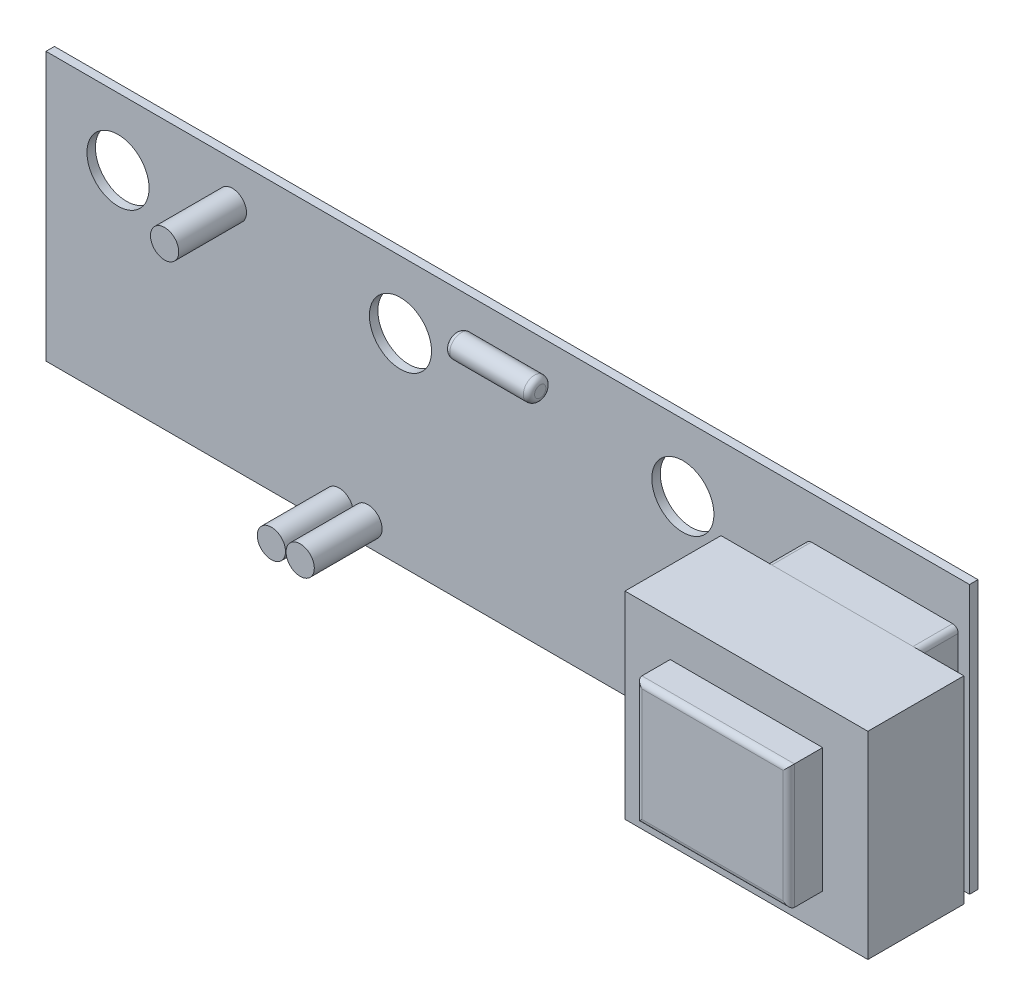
from build123d import *

# Parameters (mm, degrees)
ESQUISSE1_W        = 163.5
ESQUISSE1_H        = 47.5
ESQUISSE1_R        = 5.5
EXTRUSION1_DEPTH   = 1.5
ESQUISSE3_W        = 27
ESQUISSE3_H        = 35
EXTRUSION2_DEPTH   = 7
CONG_1_R           = 1
ESQUISSE4_W        = 43
ESQUISSE4_H        = 35
EXTRUSION3_DEPTH   = 17
ESQUISSE5_W        = 27
ESQUISSE5_H        = 22
EXTRUSION4_DEPTH   = 6
CONG_2_R           = 1
ESQUISSE6_R        = 2.5
EXTRUSION6_DEPTH   = 12
EXTRUSION6_2_DEPTH = 12
EXTRUSION6_3_DEPTH = 12
EXTRUSION7_START   = 20
ESQUISSE7_R        = 2
EXTRUSION7_DEPTH   = 15
CONG_3_R           = 1
EXTRUSION8_START   = 60
ESQUISSE8_R        = 1.5
EXTRUSION8_DEPTH   = 10
CONG_4_R           = 0.4


with BuildPart() as part:
    # Esquisse1 → Extrusion1 (new body)
    with BuildSketch(Plane.XY):
        with Locations((27.25, 10.25)):
            Rectangle(ESQUISSE1_W, ESQUISSE1_H)
        with Locations((-41.75, 22.13)):
            Circle(ESQUISSE1_R, mode=Mode.SUBTRACT)
        with Locations((8.25, 22.13)):
            Circle(ESQUISSE1_R, mode=Mode.SUBTRACT)
        with Locations((58.25, 22.13)):
            Circle(ESQUISSE1_R, mode=Mode.SUBTRACT)
    extrude(amount=EXTRUSION1_DEPTH)

    # Esquisse3 → Extrusion2 (add)
    with BuildSketch(Plane.XY.offset(1.5)):
        with Locations((93.5, 9)):
            Rectangle(ESQUISSE3_W, ESQUISSE3_H)
    extrude(amount=EXTRUSION2_DEPTH)

    # Cong_1
    cong_1_edges = [part.edges().sort_by_distance(p)[0] for p in [
        (80, 26.5, 5),
        (80, -8.5, 5),
        (107, -8.5, 5),
        (107, 26.5, 5),
    ]]
    fillet(cong_1_edges, radius=CONG_1_R)


with BuildPart() as body_2:
    # Esquisse4 → Extrusion3 (new body)
    with BuildSketch(Plane.XY.offset(8.5)):
        with Locations((93.5, 9)):
            Rectangle(ESQUISSE4_W, ESQUISSE4_H)
    extrude(amount=EXTRUSION3_DEPTH)


with BuildPart() as body_3:
    # Esquisse5 → Extrusion4 (new body)
    with BuildSketch(Plane.XY.offset(25.5)):
        with Locations((93.5, 9)):
            Rectangle(ESQUISSE5_W, ESQUISSE5_H)
    extrude(amount=EXTRUSION4_DEPTH)

    # Cong_2
    cong_2_edges = [body_3.edges().sort_by_distance(p)[0] for p in [
        (107, 9, 31.5),
        (93.5, 20, 31.5),
        (80, 9, 31.5),
        (93.5, -2, 31.5),
    ]]
    fillet(cong_2_edges, radius=CONG_2_R)


with BuildPart() as body_4:
    # Esquisse6 → Extrusion6 (new body)
    with BuildSketch(Plane.XY.offset(1.5)):
        with Locations((-2.6, -9.5)):
            Circle(ESQUISSE6_R)
    extrude(amount=EXTRUSION6_DEPTH)


with BuildPart() as body_5:
    # Esquisse6 → Extrusion6 2 (new body)
    with BuildSketch(Plane.XY.offset(1.5)):
        with Locations((2.5, -9.5)):
            Circle(ESQUISSE6_R)
    extrude(amount=EXTRUSION6_2_DEPTH)


with BuildPart() as body_6:
    # Esquisse6 → Extrusion6 3 (new body)
    with BuildSketch(Plane.XY.offset(1.5)):
        with Locations((-21.5, 27)):
            Circle(ESQUISSE6_R)
    extrude(amount=EXTRUSION6_3_DEPTH)


with BuildPart() as body_7:
    # Esquisse7 → Extrusion7 (new body)
    with BuildSketch(Plane(origin=(0, 0, 0), x_dir=(0, 0, -1), z_dir=(1, 0, 0)).offset(EXTRUSION7_START)):
        with Locations((-3.5, 27.615102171)):
            Circle(ESQUISSE7_R)
    extrude(amount=EXTRUSION7_DEPTH)

    # Cong_3
    cong_3_edges = [body_7.edges().sort_by_distance(p)[0] for p in [
        (20, 27.615102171, 5.5),
        (35, 27.615102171, 5.5),
    ]]
    fillet(cong_3_edges, radius=CONG_3_R)


with BuildPart() as body_8:
    # Esquisse8 → Extrusion8 (new body)
    with BuildSketch(Plane(origin=(0, 0, 0), x_dir=(0, 0, -1), z_dir=(1, 0, 0)).offset(EXTRUSION8_START)):
        with Locations((-3, -5.750159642)):
            Circle(ESQUISSE8_R)
    extrude(amount=EXTRUSION8_DEPTH)

    # Cong_4
    cong_4_edges = [body_8.edges().sort_by_distance(p)[0] for p in [
        (60, -5.750159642, 4.5),
        (70, -5.750159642, 4.5),
    ]]
    fillet(cong_4_edges, radius=CONG_4_R)


solid = Compound([part.part, body_2.part, body_3.part, body_4.part, body_5.part, body_6.part, body_7.part, body_8.part])
